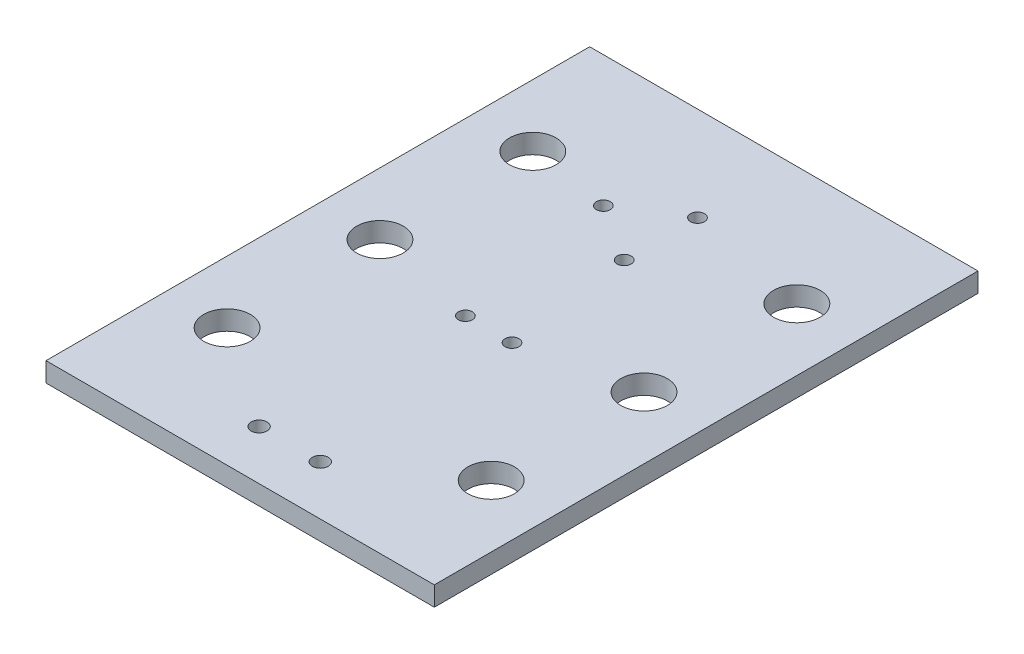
from build123d import *

# Parameters (mm, degrees)
SKETCH1_W           = 31.75
SKETCH1_H           = 44.45
SKETCH1_R           = 1.905
SKETCH1_R_2         = 0.6477
SKETCH1_R_3         = 0.5715
BOSS_EXTRUDE1_DEPTH = 1.5875


with BuildPart() as part:
    # Sketch1 → Boss-Extrude1 (new body)
    with BuildSketch(Plane(origin=(0, 0, 0), x_dir=(1, 0, 0), z_dir=(0, 1, 0))):
        with Locations((0, 22.225)):
            Rectangle(SKETCH1_W, SKETCH1_H)
        with Locations(Location((-10.795, 9.72566, 0), (0, 0, 270))):
            Circle(SKETCH1_R, mode=Mode.SUBTRACT)
        with Locations(Location((-10.795, 22.225, 0), (0, 0, 270))):
            Circle(SKETCH1_R, mode=Mode.SUBTRACT)
        with Locations(Location((-10.795, 34.7218, 0), (0, 0, 270))):
            Circle(SKETCH1_R, mode=Mode.SUBTRACT)
        with Locations(Location((-2.49936, 4.04876, 0), (0, 0, 270))):
            Circle(SKETCH1_R_2, mode=Mode.SUBTRACT)
        with Locations(Location((-1.905, 20.32, 0), (0, 0, 270))):
            Circle(SKETCH1_R_3, mode=Mode.SUBTRACT)
        with Locations(Location((0.635, 30.7594, 0), (0, 0, 270))):
            Circle(SKETCH1_R_3, mode=Mode.SUBTRACT)
        with Locations(Location((-4.064, 33.7566, 0), (0, 0, 270))):
            Circle(SKETCH1_R_3, mode=Mode.SUBTRACT)
        with Locations(Location((0.635, 36.7538, 0), (0, 0, 270))):
            Circle(SKETCH1_R_3, mode=Mode.SUBTRACT)
        with Locations(Location((10.795, 34.7218, 0), (0, 0, 90))):
            Circle(SKETCH1_R, mode=Mode.SUBTRACT)
        with Locations(Location((1.905, 20.32, 0), (0, 0, 90))):
            Circle(SKETCH1_R_3, mode=Mode.SUBTRACT)
        with Locations(Location((10.795, 22.225, 0), (0, 0, 90))):
            Circle(SKETCH1_R, mode=Mode.SUBTRACT)
        with Locations(Location((10.795, 9.72566, 0), (0, 0, 90))):
            Circle(SKETCH1_R, mode=Mode.SUBTRACT)
        with Locations(Location((2.49936, 4.04876, 0), (0, 0, 90))):
            Circle(SKETCH1_R_2, mode=Mode.SUBTRACT)
    extrude(amount=BOSS_EXTRUDE1_DEPTH)


solid = part.part
